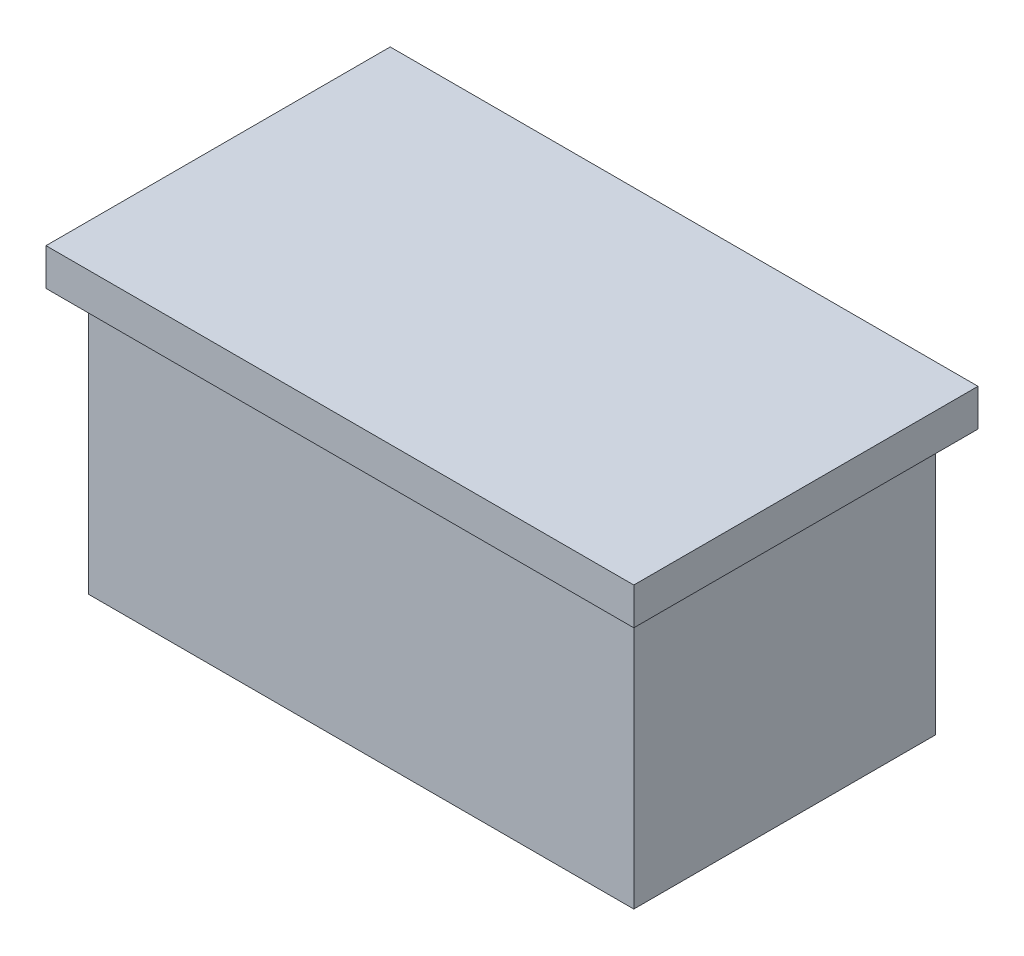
ISO-10303-21;
HEADER;
FILE_DESCRIPTION(('STEP AP214'),'2;1');
FILE_NAME('part.step','',(''),(''),'','','');
FILE_SCHEMA(('AUTOMOTIVE_DESIGN { 1 0 10303 214 1 1 1 1 }'));
ENDSEC;
DATA;
#1=APPLICATION_CONTEXT('core data for automotive mechanical design processes');
#2=APPLICATION_PROTOCOL_DEFINITION('international standard','automotive_design',2000,#1);
#3=PRODUCT_CONTEXT('',#1,'mechanical');
#4=PRODUCT('Part','Part','',(#3));
#5=PRODUCT_RELATED_PRODUCT_CATEGORY('part','',(#4));
#6=PRODUCT_DEFINITION_FORMATION('','',#4);
#7=PRODUCT_DEFINITION_CONTEXT('part definition',#1,'design');
#8=PRODUCT_DEFINITION('design','',#6,#7);
#9=PRODUCT_DEFINITION_SHAPE('','',#8);
#10=(LENGTH_UNIT() NAMED_UNIT(*) SI_UNIT(.MILLI.,.METRE.));
#11=(NAMED_UNIT(*) PLANE_ANGLE_UNIT() SI_UNIT($,.RADIAN.));
#12=(NAMED_UNIT(*) SI_UNIT($,.STERADIAN.) SOLID_ANGLE_UNIT());
#13=UNCERTAINTY_MEASURE_WITH_UNIT(LENGTH_MEASURE(1.E-05),#10,'distance_accuracy_value','');
#14=(GEOMETRIC_REPRESENTATION_CONTEXT(3) GLOBAL_UNCERTAINTY_ASSIGNED_CONTEXT((#13)) GLOBAL_UNIT_ASSIGNED_CONTEXT((#10,
#11,#12)) REPRESENTATION_CONTEXT('',''));
#15=CARTESIAN_POINT('',(0.,0.,0.));
#16=DIRECTION('',(0.,0.,1.));
#17=DIRECTION('',(1.,0.,0.));
#18=AXIS2_PLACEMENT_3D('',#15,#16,#17);
#19=CARTESIAN_POINT('',(51.5,50.,28.5));
#20=DIRECTION('',(-1.,0.,0.));
#21=DIRECTION('',(0.,0.,1.));
#22=AXIS2_PLACEMENT_3D('',#19,#20,#21);
#23=PLANE('',#22);
#24=DIRECTION('',(0.,0.,-1.));
#25=VECTOR('',#24,1.);
#26=CARTESIAN_POINT('',(51.5,0.,28.5));
#27=LINE('',#26,#25);
#28=CARTESIAN_POINT('',(51.5,0.,28.5));
#29=VERTEX_POINT('',#28);
#30=CARTESIAN_POINT('',(51.5,0.,-28.5));
#31=VERTEX_POINT('',#30);
#32=EDGE_CURVE('E129',#29,#31,#27,.T.);
#33=ORIENTED_EDGE('',*,*,#32,.T.);
#34=DIRECTION('',(0.,-1.,0.));
#35=VECTOR('',#34,1.);
#36=CARTESIAN_POINT('',(51.5,50.,-28.5));
#37=LINE('',#36,#35);
#38=CARTESIAN_POINT('',(51.5,50.,-28.5));
#39=VERTEX_POINT('',#38);
#40=EDGE_CURVE('E11',#39,#31,#37,.T.);
#41=ORIENTED_EDGE('',*,*,#40,.F.);
#42=DIRECTION('',(0.,0.,-1.));
#43=VECTOR('',#42,1.);
#44=CARTESIAN_POINT('',(51.5,50.,28.5));
#45=LINE('',#44,#43);
#46=CARTESIAN_POINT('',(51.5,50.,28.5));
#47=VERTEX_POINT('',#46);
#48=EDGE_CURVE('E138',#47,#39,#45,.T.);
#49=ORIENTED_EDGE('',*,*,#48,.F.);
#50=DIRECTION('',(0.,-1.,0.));
#51=VECTOR('',#50,1.);
#52=CARTESIAN_POINT('',(51.5,50.,28.5));
#53=LINE('',#52,#51);
#54=EDGE_CURVE('E147',#47,#29,#53,.T.);
#55=ORIENTED_EDGE('',*,*,#54,.T.);
#56=EDGE_LOOP('',(#33,#41,#49,#55));
#57=FACE_BOUND('',#56,.T.);
#58=ADVANCED_FACE('F31',(#57),#23,.F.);
#59=CARTESIAN_POINT('',(-51.5,50.,-28.5));
#60=DIRECTION('',(0.,0.,1.));
#61=DIRECTION('',(1.,0.,0.));
#62=AXIS2_PLACEMENT_3D('',#59,#60,#61);
#63=PLANE('',#62);
#64=DIRECTION('',(-1.,0.,0.));
#65=VECTOR('',#64,1.);
#66=CARTESIAN_POINT('',(-51.5,0.,-28.5));
#67=LINE('',#66,#65);
#68=CARTESIAN_POINT('',(-51.5,0.,-28.5));
#69=VERTEX_POINT('',#68);
#70=EDGE_CURVE('E132',#31,#69,#67,.T.);
#71=ORIENTED_EDGE('',*,*,#70,.T.);
#72=DIRECTION('',(0.,-1.,0.));
#73=VECTOR('',#72,1.);
#74=CARTESIAN_POINT('',(-51.5,50.,-28.5));
#75=LINE('',#74,#73);
#76=CARTESIAN_POINT('',(-51.5,50.,-28.5));
#77=VERTEX_POINT('',#76);
#78=EDGE_CURVE('E39',#77,#69,#75,.T.);
#79=ORIENTED_EDGE('',*,*,#78,.F.);
#80=DIRECTION('',(-1.,0.,0.));
#81=VECTOR('',#80,1.);
#82=CARTESIAN_POINT('',(-51.5,50.,-28.5));
#83=LINE('',#82,#81);
#84=EDGE_CURVE('E73',#39,#77,#83,.T.);
#85=ORIENTED_EDGE('',*,*,#84,.F.);
#86=ORIENTED_EDGE('',*,*,#40,.T.);
#87=EDGE_LOOP('',(#71,#79,#85,#86));
#88=FACE_BOUND('',#87,.T.);
#89=ADVANCED_FACE('F173',(#88),#63,.F.);
#90=CARTESIAN_POINT('',(-51.5,50.,28.5));
#91=DIRECTION('',(1.,0.,0.));
#92=DIRECTION('',(0.,0.,-1.));
#93=AXIS2_PLACEMENT_3D('',#90,#91,#92);
#94=PLANE('',#93);
#95=DIRECTION('',(0.,0.,1.));
#96=VECTOR('',#95,1.);
#97=CARTESIAN_POINT('',(-51.5,0.,28.5));
#98=LINE('',#97,#96);
#99=CARTESIAN_POINT('',(-51.5,0.,28.5));
#100=VERTEX_POINT('',#99);
#101=EDGE_CURVE('E63',#69,#100,#98,.T.);
#102=ORIENTED_EDGE('',*,*,#101,.T.);
#103=DIRECTION('',(0.,-1.,0.));
#104=VECTOR('',#103,1.);
#105=CARTESIAN_POINT('',(-51.5,50.,28.5));
#106=LINE('',#105,#104);
#107=CARTESIAN_POINT('',(-51.5,50.,28.5));
#108=VERTEX_POINT('',#107);
#109=EDGE_CURVE('E47',#108,#100,#106,.T.);
#110=ORIENTED_EDGE('',*,*,#109,.F.);
#111=DIRECTION('',(0.,0.,1.));
#112=VECTOR('',#111,1.);
#113=CARTESIAN_POINT('',(-51.5,50.,28.5));
#114=LINE('',#113,#112);
#115=EDGE_CURVE('E142',#77,#108,#114,.T.);
#116=ORIENTED_EDGE('',*,*,#115,.F.);
#117=ORIENTED_EDGE('',*,*,#78,.T.);
#118=EDGE_LOOP('',(#102,#110,#116,#117));
#119=FACE_BOUND('',#118,.T.);
#120=ADVANCED_FACE('F153',(#119),#94,.F.);
#121=CARTESIAN_POINT('',(-51.5,50.,28.5));
#122=DIRECTION('',(0.,0.,-1.));
#123=DIRECTION('',(-1.,0.,0.));
#124=AXIS2_PLACEMENT_3D('',#121,#122,#123);
#125=PLANE('',#124);
#126=DIRECTION('',(1.,0.,0.));
#127=VECTOR('',#126,1.);
#128=CARTESIAN_POINT('',(-51.5,0.,28.5));
#129=LINE('',#128,#127);
#130=EDGE_CURVE('E68',#100,#29,#129,.T.);
#131=ORIENTED_EDGE('',*,*,#130,.T.);
#132=ORIENTED_EDGE('',*,*,#54,.F.);
#133=DIRECTION('',(1.,0.,0.));
#134=VECTOR('',#133,1.);
#135=CARTESIAN_POINT('',(-51.5,50.,28.5));
#136=LINE('',#135,#134);
#137=EDGE_CURVE('E145',#108,#47,#136,.T.);
#138=ORIENTED_EDGE('',*,*,#137,.F.);
#139=ORIENTED_EDGE('',*,*,#109,.T.);
#140=EDGE_LOOP('',(#131,#132,#138,#139));
#141=FACE_BOUND('',#140,.T.);
#142=ADVANCED_FACE('F158',(#141),#125,.F.);
#143=CARTESIAN_POINT('',(51.5,0.,-28.5));
#144=DIRECTION('',(0.,-1.,0.));
#145=DIRECTION('',(0.,0.,-1.));
#146=AXIS2_PLACEMENT_3D('',#143,#144,#145);
#147=PLANE('',#146);
#148=ORIENTED_EDGE('',*,*,#32,.F.);
#149=ORIENTED_EDGE('',*,*,#130,.F.);
#150=ORIENTED_EDGE('',*,*,#101,.F.);
#151=ORIENTED_EDGE('',*,*,#70,.F.);
#152=EDGE_LOOP('',(#148,#149,#150,#151));
#153=FACE_BOUND('',#152,.T.);
#154=ADVANCED_FACE('F156',(#153),#147,.T.);
#155=CARTESIAN_POINT('',(55.5,50.,-32.5));
#156=DIRECTION('',(0.,-1.,0.));
#157=DIRECTION('',(0.,0.,-1.));
#158=AXIS2_PLACEMENT_3D('',#155,#156,#157);
#159=PLANE('',#158);
#160=DIRECTION('',(0.,0.,-1.));
#161=VECTOR('',#160,1.);
#162=CARTESIAN_POINT('',(55.5,50.,32.5));
#163=LINE('',#162,#161);
#164=CARTESIAN_POINT('',(55.5,50.,32.5));
#165=VERTEX_POINT('',#164);
#166=CARTESIAN_POINT('',(55.5,50.,-32.5));
#167=VERTEX_POINT('',#166);
#168=EDGE_CURVE('E128',#165,#167,#163,.T.);
#169=ORIENTED_EDGE('',*,*,#168,.F.);
#170=DIRECTION('',(1.,0.,0.));
#171=VECTOR('',#170,1.);
#172=CARTESIAN_POINT('',(-55.5,50.,32.5));
#173=LINE('',#172,#171);
#174=CARTESIAN_POINT('',(-55.5,50.,32.5));
#175=VERTEX_POINT('',#174);
#176=EDGE_CURVE('E124',#175,#165,#173,.T.);
#177=ORIENTED_EDGE('',*,*,#176,.F.);
#178=DIRECTION('',(0.,0.,1.));
#179=VECTOR('',#178,1.);
#180=CARTESIAN_POINT('',(-55.5,50.,32.5));
#181=LINE('',#180,#179);
#182=CARTESIAN_POINT('',(-55.5,50.,-32.5));
#183=VERTEX_POINT('',#182);
#184=EDGE_CURVE('E200',#183,#175,#181,.T.);
#185=ORIENTED_EDGE('',*,*,#184,.F.);
#186=DIRECTION('',(-1.,0.,0.));
#187=VECTOR('',#186,1.);
#188=CARTESIAN_POINT('',(-55.5,50.,-32.5));
#189=LINE('',#188,#187);
#190=EDGE_CURVE('E203',#167,#183,#189,.T.);
#191=ORIENTED_EDGE('',*,*,#190,.F.);
#192=EDGE_LOOP('',(#169,#177,#185,#191));
#193=FACE_BOUND('',#192,.T.);
#194=ORIENTED_EDGE('',*,*,#48,.T.);
#195=ORIENTED_EDGE('',*,*,#84,.T.);
#196=ORIENTED_EDGE('',*,*,#115,.T.);
#197=ORIENTED_EDGE('',*,*,#137,.T.);
#198=EDGE_LOOP('',(#194,#195,#196,#197));
#199=FACE_BOUND('',#198,.T.);
#200=ADVANCED_FACE('F160',(#193,#199),#159,.T.);
#201=CARTESIAN_POINT('',(55.5,57.,32.5));
#202=DIRECTION('',(-1.,0.,0.));
#203=DIRECTION('',(0.,0.,1.));
#204=AXIS2_PLACEMENT_3D('',#201,#202,#203);
#205=PLANE('',#204);
#206=ORIENTED_EDGE('',*,*,#168,.T.);
#207=DIRECTION('',(0.,-1.,0.));
#208=VECTOR('',#207,1.);
#209=CARTESIAN_POINT('',(55.5,57.,-32.5));
#210=LINE('',#209,#208);
#211=CARTESIAN_POINT('',(55.5,57.,-32.5));
#212=VERTEX_POINT('',#211);
#213=EDGE_CURVE('E108',#212,#167,#210,.T.);
#214=ORIENTED_EDGE('',*,*,#213,.F.);
#215=DIRECTION('',(0.,0.,-1.));
#216=VECTOR('',#215,1.);
#217=CARTESIAN_POINT('',(55.5,57.,32.5));
#218=LINE('',#217,#216);
#219=CARTESIAN_POINT('',(55.5,57.,32.5));
#220=VERTEX_POINT('',#219);
#221=EDGE_CURVE('E115',#220,#212,#218,.T.);
#222=ORIENTED_EDGE('',*,*,#221,.F.);
#223=DIRECTION('',(0.,-1.,0.));
#224=VECTOR('',#223,1.);
#225=CARTESIAN_POINT('',(55.5,57.,32.5));
#226=LINE('',#225,#224);
#227=EDGE_CURVE('E197',#220,#165,#226,.T.);
#228=ORIENTED_EDGE('',*,*,#227,.T.);
#229=EDGE_LOOP('',(#206,#214,#222,#228));
#230=FACE_BOUND('',#229,.T.);
#231=ADVANCED_FACE('F126',(#230),#205,.F.);
#232=CARTESIAN_POINT('',(-55.5,57.,-32.5));
#233=DIRECTION('',(0.,0.,1.));
#234=DIRECTION('',(1.,0.,0.));
#235=AXIS2_PLACEMENT_3D('',#232,#233,#234);
#236=PLANE('',#235);
#237=ORIENTED_EDGE('',*,*,#190,.T.);
#238=DIRECTION('',(0.,-1.,0.));
#239=VECTOR('',#238,1.);
#240=CARTESIAN_POINT('',(-55.5,57.,-32.5));
#241=LINE('',#240,#239);
#242=CARTESIAN_POINT('',(-55.5,57.,-32.5));
#243=VERTEX_POINT('',#242);
#244=EDGE_CURVE('E111',#243,#183,#241,.T.);
#245=ORIENTED_EDGE('',*,*,#244,.F.);
#246=DIRECTION('',(-1.,0.,0.));
#247=VECTOR('',#246,1.);
#248=CARTESIAN_POINT('',(-55.5,57.,-32.5));
#249=LINE('',#248,#247);
#250=EDGE_CURVE('E104',#212,#243,#249,.T.);
#251=ORIENTED_EDGE('',*,*,#250,.F.);
#252=ORIENTED_EDGE('',*,*,#213,.T.);
#253=EDGE_LOOP('',(#237,#245,#251,#252));
#254=FACE_BOUND('',#253,.T.);
#255=ADVANCED_FACE('F106',(#254),#236,.F.);
#256=CARTESIAN_POINT('',(-55.5,57.,32.5));
#257=DIRECTION('',(1.,0.,0.));
#258=DIRECTION('',(0.,0.,-1.));
#259=AXIS2_PLACEMENT_3D('',#256,#257,#258);
#260=PLANE('',#259);
#261=ORIENTED_EDGE('',*,*,#184,.T.);
#262=DIRECTION('',(0.,-1.,0.));
#263=VECTOR('',#262,1.);
#264=CARTESIAN_POINT('',(-55.5,57.,32.5));
#265=LINE('',#264,#263);
#266=CARTESIAN_POINT('',(-55.5,57.,32.5));
#267=VERTEX_POINT('',#266);
#268=EDGE_CURVE('E134',#267,#175,#265,.T.);
#269=ORIENTED_EDGE('',*,*,#268,.F.);
#270=DIRECTION('',(0.,0.,1.));
#271=VECTOR('',#270,1.);
#272=CARTESIAN_POINT('',(-55.5,57.,32.5));
#273=LINE('',#272,#271);
#274=EDGE_CURVE('E114',#243,#267,#273,.T.);
#275=ORIENTED_EDGE('',*,*,#274,.F.);
#276=ORIENTED_EDGE('',*,*,#244,.T.);
#277=EDGE_LOOP('',(#261,#269,#275,#276));
#278=FACE_BOUND('',#277,.T.);
#279=ADVANCED_FACE('F186',(#278),#260,.F.);
#280=CARTESIAN_POINT('',(-55.5,57.,32.5));
#281=DIRECTION('',(0.,0.,-1.));
#282=DIRECTION('',(-1.,0.,0.));
#283=AXIS2_PLACEMENT_3D('',#280,#281,#282);
#284=PLANE('',#283);
#285=ORIENTED_EDGE('',*,*,#176,.T.);
#286=ORIENTED_EDGE('',*,*,#227,.F.);
#287=DIRECTION('',(1.,0.,0.));
#288=VECTOR('',#287,1.);
#289=CARTESIAN_POINT('',(-55.5,57.,32.5));
#290=LINE('',#289,#288);
#291=EDGE_CURVE('E120',#267,#220,#290,.T.);
#292=ORIENTED_EDGE('',*,*,#291,.F.);
#293=ORIENTED_EDGE('',*,*,#268,.T.);
#294=EDGE_LOOP('',(#285,#286,#292,#293));
#295=FACE_BOUND('',#294,.T.);
#296=ADVANCED_FACE('F188',(#295),#284,.F.);
#297=CARTESIAN_POINT('',(55.5,57.,-32.5));
#298=DIRECTION('',(0.,-1.,0.));
#299=DIRECTION('',(0.,0.,-1.));
#300=AXIS2_PLACEMENT_3D('',#297,#298,#299);
#301=PLANE('',#300);
#302=ORIENTED_EDGE('',*,*,#221,.T.);
#303=ORIENTED_EDGE('',*,*,#250,.T.);
#304=ORIENTED_EDGE('',*,*,#274,.T.);
#305=ORIENTED_EDGE('',*,*,#291,.T.);
#306=EDGE_LOOP('',(#302,#303,#304,#305));
#307=FACE_BOUND('',#306,.T.);
#308=ADVANCED_FACE('F118',(#307),#301,.F.);
#309=CLOSED_SHELL('',(#58,#89,#120,#142,#154,#200,#231,#255,#279,#296,#308));
#310=MANIFOLD_SOLID_BREP('B2',#309);
#311=ADVANCED_BREP_SHAPE_REPRESENTATION('',(#18,#310),#14);
#312=SHAPE_DEFINITION_REPRESENTATION(#9,#311);
ENDSEC;
END-ISO-10303-21;
